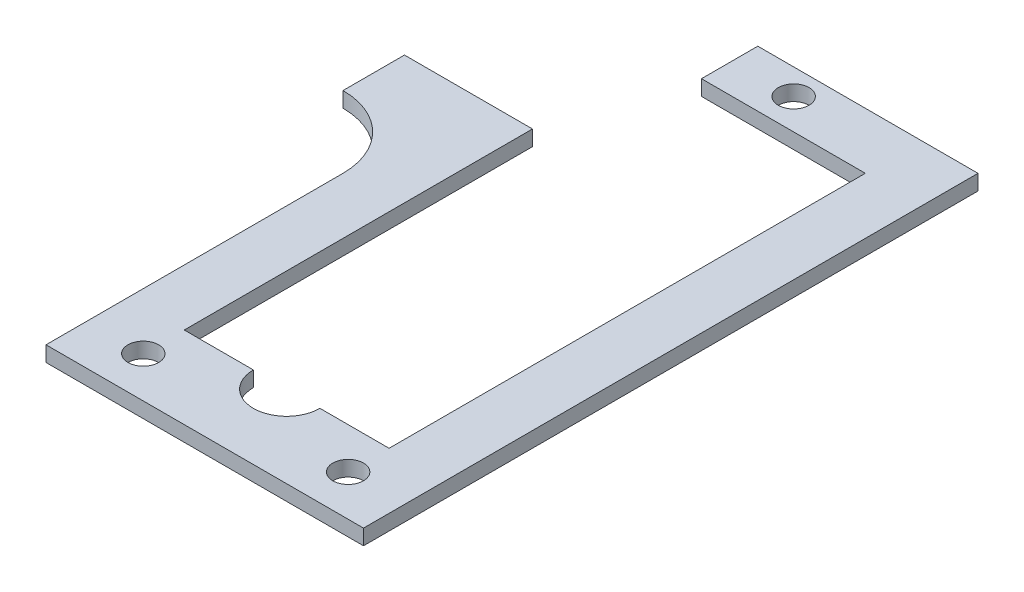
ISO-10303-21;
HEADER;
FILE_DESCRIPTION(('STEP AP214'),'2;1');
FILE_NAME('part.step','',(''),(''),'','','');
FILE_SCHEMA(('AUTOMOTIVE_DESIGN { 1 0 10303 214 1 1 1 1 }'));
ENDSEC;
DATA;
#1=APPLICATION_CONTEXT('core data for automotive mechanical design processes');
#2=APPLICATION_PROTOCOL_DEFINITION('international standard','automotive_design',2000,#1);
#3=PRODUCT_CONTEXT('',#1,'mechanical');
#4=PRODUCT('Part','Part','',(#3));
#5=PRODUCT_RELATED_PRODUCT_CATEGORY('part','',(#4));
#6=PRODUCT_DEFINITION_FORMATION('','',#4);
#7=PRODUCT_DEFINITION_CONTEXT('part definition',#1,'design');
#8=PRODUCT_DEFINITION('design','',#6,#7);
#9=PRODUCT_DEFINITION_SHAPE('','',#8);
#10=(LENGTH_UNIT() NAMED_UNIT(*) SI_UNIT(.MILLI.,.METRE.));
#11=(NAMED_UNIT(*) PLANE_ANGLE_UNIT() SI_UNIT($,.RADIAN.));
#12=(NAMED_UNIT(*) SI_UNIT($,.STERADIAN.) SOLID_ANGLE_UNIT());
#13=UNCERTAINTY_MEASURE_WITH_UNIT(LENGTH_MEASURE(1.E-05),#10,'distance_accuracy_value','');
#14=(GEOMETRIC_REPRESENTATION_CONTEXT(3) GLOBAL_UNCERTAINTY_ASSIGNED_CONTEXT((#13)) GLOBAL_UNIT_ASSIGNED_CONTEXT((#10,
#11,#12)) REPRESENTATION_CONTEXT('',''));
#15=CARTESIAN_POINT('',(0.,0.,0.));
#16=DIRECTION('',(0.,0.,1.));
#17=DIRECTION('',(1.,0.,0.));
#18=AXIS2_PLACEMENT_3D('',#15,#16,#17);
#19=CARTESIAN_POINT('',(-14.,3.,-58.));
#20=DIRECTION('',(0.,1.,0.));
#21=DIRECTION('',(0.,0.,1.));
#22=AXIS2_PLACEMENT_3D('',#19,#20,#21);
#23=PLANE('',#22);
#24=CARTESIAN_POINT('',(51.,3.,-8.));
#25=DIRECTION('',(0.,1.,0.));
#26=DIRECTION('',(0.,0.,1.));
#27=AXIS2_PLACEMENT_3D('',#24,#25,#26);
#28=CIRCLE('',#27,3.);
#29=CARTESIAN_POINT('',(51.,3.,-5.));
#30=VERTEX_POINT('',#29);
#31=EDGE_CURVE('E311',#30,#30,#28,.T.);
#32=ORIENTED_EDGE('',*,*,#31,.F.);
#33=EDGE_LOOP('',(#32));
#34=FACE_BOUND('',#33,.T.);
#35=DIRECTION('',(0.,0.,1.));
#36=VECTOR('',#35,1.);
#37=CARTESIAN_POINT('',(0.,3.,0.));
#38=LINE('',#37,#36);
#39=CARTESIAN_POINT('',(0.,3.,-58.));
#40=VERTEX_POINT('',#39);
#41=CARTESIAN_POINT('',(0.,3.,0.));
#42=VERTEX_POINT('',#41);
#43=EDGE_CURVE('E191',#40,#42,#38,.T.);
#44=ORIENTED_EDGE('',*,*,#43,.T.);
#45=DIRECTION('',(1.,0.,0.));
#46=VECTOR('',#45,1.);
#47=CARTESIAN_POINT('',(0.,3.,0.));
#48=LINE('',#47,#46);
#49=CARTESIAN_POINT('',(62.,3.,0.));
#50=VERTEX_POINT('',#49);
#51=EDGE_CURVE('E109',#42,#50,#48,.T.);
#52=ORIENTED_EDGE('',*,*,#51,.T.);
#53=DIRECTION('',(0.,0.,-1.));
#54=VECTOR('',#53,1.);
#55=CARTESIAN_POINT('',(62.,3.,0.));
#56=LINE('',#55,#54);
#57=CARTESIAN_POINT('',(62.,3.,-120.));
#58=VERTEX_POINT('',#57);
#59=EDGE_CURVE('E224',#50,#58,#56,.T.);
#60=ORIENTED_EDGE('',*,*,#59,.T.);
#61=DIRECTION('',(-1.,0.,0.));
#62=VECTOR('',#61,1.);
#63=CARTESIAN_POINT('',(19.,3.,-120.));
#64=LINE('',#63,#62);
#65=CARTESIAN_POINT('',(19.,3.,-120.));
#66=VERTEX_POINT('',#65);
#67=EDGE_CURVE('E243',#58,#66,#64,.T.);
#68=ORIENTED_EDGE('',*,*,#67,.T.);
#69=DIRECTION('',(0.,0.,1.));
#70=VECTOR('',#69,1.);
#71=CARTESIAN_POINT('',(19.,3.,-120.));
#72=LINE('',#71,#70);
#73=CARTESIAN_POINT('',(19.,3.,-109.));
#74=VERTEX_POINT('',#73);
#75=EDGE_CURVE('E240',#66,#74,#72,.T.);
#76=ORIENTED_EDGE('',*,*,#75,.T.);
#77=DIRECTION('',(1.,0.,0.));
#78=VECTOR('',#77,1.);
#79=CARTESIAN_POINT('',(19.,3.,-109.));
#80=LINE('',#79,#78);
#81=CARTESIAN_POINT('',(51.,3.,-109.));
#82=VERTEX_POINT('',#81);
#83=EDGE_CURVE('E242',#74,#82,#80,.T.);
#84=ORIENTED_EDGE('',*,*,#83,.T.);
#85=DIRECTION('',(0.,0.,1.));
#86=VECTOR('',#85,1.);
#87=CARTESIAN_POINT('',(51.,3.,-16.));
#88=LINE('',#87,#86);
#89=CARTESIAN_POINT('',(51.,3.,-16.));
#90=VERTEX_POINT('',#89);
#91=EDGE_CURVE('E245',#82,#90,#88,.T.);
#92=ORIENTED_EDGE('',*,*,#91,.T.);
#93=DIRECTION('',(-1.,0.,0.));
#94=VECTOR('',#93,1.);
#95=CARTESIAN_POINT('',(37.5,3.,-16.));
#96=LINE('',#95,#94);
#97=CARTESIAN_POINT('',(37.5,3.,-16.));
#98=VERTEX_POINT('',#97);
#99=EDGE_CURVE('E251',#90,#98,#96,.T.);
#100=ORIENTED_EDGE('',*,*,#99,.T.);
#101=CARTESIAN_POINT('',(31.,3.,-16.));
#102=DIRECTION('',(0.,-1.,0.));
#103=DIRECTION('',(0.,0.,1.));
#104=AXIS2_PLACEMENT_3D('',#101,#102,#103);
#105=CIRCLE('',#104,6.5);
#106=CARTESIAN_POINT('',(24.5,3.,-16.));
#107=VERTEX_POINT('',#106);
#108=EDGE_CURVE('E253',#98,#107,#105,.T.);
#109=ORIENTED_EDGE('',*,*,#108,.T.);
#110=DIRECTION('',(-1.,0.,0.));
#111=VECTOR('',#110,1.);
#112=CARTESIAN_POINT('',(11.,3.,-16.));
#113=LINE('',#112,#111);
#114=CARTESIAN_POINT('',(11.,3.,-16.));
#115=VERTEX_POINT('',#114);
#116=EDGE_CURVE('E255',#107,#115,#113,.T.);
#117=ORIENTED_EDGE('',*,*,#116,.T.);
#118=DIRECTION('',(0.,0.,-1.));
#119=VECTOR('',#118,1.);
#120=CARTESIAN_POINT('',(11.,3.,-16.));
#121=LINE('',#120,#119);
#122=CARTESIAN_POINT('',(11.,3.,-84.));
#123=VERTEX_POINT('',#122);
#124=EDGE_CURVE('E146',#115,#123,#121,.T.);
#125=ORIENTED_EDGE('',*,*,#124,.T.);
#126=DIRECTION('',(-1.,0.,0.));
#127=VECTOR('',#126,1.);
#128=CARTESIAN_POINT('',(11.,3.,-84.));
#129=LINE('',#128,#127);
#130=CARTESIAN_POINT('',(-14.,3.,-84.));
#131=VERTEX_POINT('',#130);
#132=EDGE_CURVE('E140',#123,#131,#129,.T.);
#133=ORIENTED_EDGE('',*,*,#132,.T.);
#134=DIRECTION('',(0.,0.,1.));
#135=VECTOR('',#134,1.);
#136=CARTESIAN_POINT('',(-14.,3.,-84.));
#137=LINE('',#136,#135);
#138=CARTESIAN_POINT('',(-14.,3.,-72.));
#139=VERTEX_POINT('',#138);
#140=EDGE_CURVE('E144',#131,#139,#137,.T.);
#141=ORIENTED_EDGE('',*,*,#140,.T.);
#142=CARTESIAN_POINT('',(-14.,3.,-58.));
#143=DIRECTION('',(0.,-1.,0.));
#144=DIRECTION('',(0.,0.,1.));
#145=AXIS2_PLACEMENT_3D('',#142,#143,#144);
#146=CIRCLE('',#145,14.);
#147=EDGE_CURVE('E48',#139,#40,#146,.T.);
#148=ORIENTED_EDGE('',*,*,#147,.T.);
#149=EDGE_LOOP('',(#44,#52,#60,#68,#76,#84,#92,#100,#109,#117,#125,#133,#141,#148));
#150=FACE_BOUND('',#149,.T.);
#151=CARTESIAN_POINT('',(11.,3.,-8.));
#152=DIRECTION('',(0.,1.,0.));
#153=DIRECTION('',(0.,0.,1.));
#154=AXIS2_PLACEMENT_3D('',#151,#152,#153);
#155=CIRCLE('',#154,3.);
#156=CARTESIAN_POINT('',(11.,3.,-5.));
#157=VERTEX_POINT('',#156);
#158=EDGE_CURVE('E168',#157,#157,#155,.T.);
#159=ORIENTED_EDGE('',*,*,#158,.F.);
#160=EDGE_LOOP('',(#159));
#161=FACE_BOUND('',#160,.T.);
#162=CARTESIAN_POINT('',(31.,3.,-115.));
#163=DIRECTION('',(0.,1.,0.));
#164=DIRECTION('',(0.,0.,1.));
#165=AXIS2_PLACEMENT_3D('',#162,#163,#164);
#166=CIRCLE('',#165,3.);
#167=CARTESIAN_POINT('',(31.,3.,-112.));
#168=VERTEX_POINT('',#167);
#169=EDGE_CURVE('E302',#168,#168,#166,.T.);
#170=ORIENTED_EDGE('',*,*,#169,.F.);
#171=EDGE_LOOP('',(#170));
#172=FACE_BOUND('',#171,.T.);
#173=ADVANCED_FACE('F31',(#34,#150,#161,#172),#23,.T.);
#174=CARTESIAN_POINT('',(-14.,0.,-58.));
#175=DIRECTION('',(0.,1.,0.));
#176=DIRECTION('',(0.,0.,1.));
#177=AXIS2_PLACEMENT_3D('',#174,#175,#176);
#178=PLANE('',#177);
#179=CARTESIAN_POINT('',(51.,0.,-8.));
#180=DIRECTION('',(0.,1.,0.));
#181=DIRECTION('',(0.,0.,1.));
#182=AXIS2_PLACEMENT_3D('',#179,#180,#181);
#183=CIRCLE('',#182,3.);
#184=CARTESIAN_POINT('',(51.,0.,-5.));
#185=VERTEX_POINT('',#184);
#186=EDGE_CURVE('E308',#185,#185,#183,.T.);
#187=ORIENTED_EDGE('',*,*,#186,.T.);
#188=EDGE_LOOP('',(#187));
#189=FACE_BOUND('',#188,.T.);
#190=DIRECTION('',(0.,0.,1.));
#191=VECTOR('',#190,1.);
#192=CARTESIAN_POINT('',(0.,0.,0.));
#193=LINE('',#192,#191);
#194=CARTESIAN_POINT('',(0.,0.,-58.));
#195=VERTEX_POINT('',#194);
#196=CARTESIAN_POINT('',(0.,0.,0.));
#197=VERTEX_POINT('',#196);
#198=EDGE_CURVE('E164',#195,#197,#193,.T.);
#199=ORIENTED_EDGE('',*,*,#198,.F.);
#200=CARTESIAN_POINT('',(-14.,0.,-58.));
#201=DIRECTION('',(0.,-1.,0.));
#202=DIRECTION('',(0.,0.,1.));
#203=AXIS2_PLACEMENT_3D('',#200,#201,#202);
#204=CIRCLE('',#203,14.);
#205=CARTESIAN_POINT('',(-14.,0.,-72.));
#206=VERTEX_POINT('',#205);
#207=EDGE_CURVE('E101',#206,#195,#204,.T.);
#208=ORIENTED_EDGE('',*,*,#207,.F.);
#209=DIRECTION('',(0.,0.,1.));
#210=VECTOR('',#209,1.);
#211=CARTESIAN_POINT('',(-14.,0.,-84.));
#212=LINE('',#211,#210);
#213=CARTESIAN_POINT('',(-14.,0.,-84.));
#214=VERTEX_POINT('',#213);
#215=EDGE_CURVE('E95',#214,#206,#212,.T.);
#216=ORIENTED_EDGE('',*,*,#215,.F.);
#217=DIRECTION('',(-1.,0.,0.));
#218=VECTOR('',#217,1.);
#219=CARTESIAN_POINT('',(11.,0.,-84.));
#220=LINE('',#219,#218);
#221=CARTESIAN_POINT('',(11.,0.,-84.));
#222=VERTEX_POINT('',#221);
#223=EDGE_CURVE('E154',#222,#214,#220,.T.);
#224=ORIENTED_EDGE('',*,*,#223,.F.);
#225=DIRECTION('',(0.,0.,-1.));
#226=VECTOR('',#225,1.);
#227=CARTESIAN_POINT('',(11.,0.,-16.));
#228=LINE('',#227,#226);
#229=CARTESIAN_POINT('',(11.,0.,-16.));
#230=VERTEX_POINT('',#229);
#231=EDGE_CURVE('E186',#230,#222,#228,.T.);
#232=ORIENTED_EDGE('',*,*,#231,.F.);
#233=DIRECTION('',(-1.,0.,0.));
#234=VECTOR('',#233,1.);
#235=CARTESIAN_POINT('',(11.,0.,-16.));
#236=LINE('',#235,#234);
#237=CARTESIAN_POINT('',(24.5,0.,-16.));
#238=VERTEX_POINT('',#237);
#239=EDGE_CURVE('E184',#238,#230,#236,.T.);
#240=ORIENTED_EDGE('',*,*,#239,.F.);
#241=CARTESIAN_POINT('',(31.,0.,-16.));
#242=DIRECTION('',(0.,-1.,0.));
#243=DIRECTION('',(0.,0.,1.));
#244=AXIS2_PLACEMENT_3D('',#241,#242,#243);
#245=CIRCLE('',#244,6.5);
#246=CARTESIAN_POINT('',(37.5,0.,-16.));
#247=VERTEX_POINT('',#246);
#248=EDGE_CURVE('E182',#247,#238,#245,.T.);
#249=ORIENTED_EDGE('',*,*,#248,.F.);
#250=DIRECTION('',(-1.,0.,0.));
#251=VECTOR('',#250,1.);
#252=CARTESIAN_POINT('',(37.5,0.,-16.));
#253=LINE('',#252,#251);
#254=CARTESIAN_POINT('',(51.,0.,-16.));
#255=VERTEX_POINT('',#254);
#256=EDGE_CURVE('E180',#255,#247,#253,.T.);
#257=ORIENTED_EDGE('',*,*,#256,.F.);
#258=DIRECTION('',(0.,0.,1.));
#259=VECTOR('',#258,1.);
#260=CARTESIAN_POINT('',(51.,0.,-16.));
#261=LINE('',#260,#259);
#262=CARTESIAN_POINT('',(51.,0.,-109.));
#263=VERTEX_POINT('',#262);
#264=EDGE_CURVE('E178',#263,#255,#261,.T.);
#265=ORIENTED_EDGE('',*,*,#264,.F.);
#266=DIRECTION('',(1.,0.,0.));
#267=VECTOR('',#266,1.);
#268=CARTESIAN_POINT('',(19.,0.,-109.));
#269=LINE('',#268,#267);
#270=CARTESIAN_POINT('',(19.,0.,-109.));
#271=VERTEX_POINT('',#270);
#272=EDGE_CURVE('E176',#271,#263,#269,.T.);
#273=ORIENTED_EDGE('',*,*,#272,.F.);
#274=DIRECTION('',(0.,0.,1.));
#275=VECTOR('',#274,1.);
#276=CARTESIAN_POINT('',(19.,0.,-120.));
#277=LINE('',#276,#275);
#278=CARTESIAN_POINT('',(19.,0.,-120.));
#279=VERTEX_POINT('',#278);
#280=EDGE_CURVE('E174',#279,#271,#277,.T.);
#281=ORIENTED_EDGE('',*,*,#280,.F.);
#282=DIRECTION('',(-1.,0.,0.));
#283=VECTOR('',#282,1.);
#284=CARTESIAN_POINT('',(19.,0.,-120.));
#285=LINE('',#284,#283);
#286=CARTESIAN_POINT('',(62.,0.,-120.));
#287=VERTEX_POINT('',#286);
#288=EDGE_CURVE('E172',#287,#279,#285,.T.);
#289=ORIENTED_EDGE('',*,*,#288,.F.);
#290=DIRECTION('',(0.,0.,-1.));
#291=VECTOR('',#290,1.);
#292=CARTESIAN_POINT('',(62.,0.,0.));
#293=LINE('',#292,#291);
#294=CARTESIAN_POINT('',(62.,0.,0.));
#295=VERTEX_POINT('',#294);
#296=EDGE_CURVE('E170',#295,#287,#293,.T.);
#297=ORIENTED_EDGE('',*,*,#296,.F.);
#298=DIRECTION('',(1.,0.,0.));
#299=VECTOR('',#298,1.);
#300=CARTESIAN_POINT('',(0.,0.,0.));
#301=LINE('',#300,#299);
#302=EDGE_CURVE('E167',#197,#295,#301,.T.);
#303=ORIENTED_EDGE('',*,*,#302,.F.);
#304=EDGE_LOOP('',(#199,#208,#216,#224,#232,#240,#249,#257,#265,#273,#281,#289,#297,#303));
#305=FACE_BOUND('',#304,.T.);
#306=CARTESIAN_POINT('',(11.,0.,-8.));
#307=DIRECTION('',(0.,1.,0.));
#308=DIRECTION('',(0.,0.,1.));
#309=AXIS2_PLACEMENT_3D('',#306,#307,#308);
#310=CIRCLE('',#309,3.);
#311=CARTESIAN_POINT('',(11.,0.,-5.));
#312=VERTEX_POINT('',#311);
#313=EDGE_CURVE('E314',#312,#312,#310,.T.);
#314=ORIENTED_EDGE('',*,*,#313,.T.);
#315=EDGE_LOOP('',(#314));
#316=FACE_BOUND('',#315,.T.);
#317=CARTESIAN_POINT('',(31.,0.,-115.));
#318=DIRECTION('',(0.,1.,0.));
#319=DIRECTION('',(0.,0.,1.));
#320=AXIS2_PLACEMENT_3D('',#317,#318,#319);
#321=CIRCLE('',#320,3.);
#322=CARTESIAN_POINT('',(31.,0.,-112.));
#323=VERTEX_POINT('',#322);
#324=EDGE_CURVE('E305',#323,#323,#321,.T.);
#325=ORIENTED_EDGE('',*,*,#324,.T.);
#326=EDGE_LOOP('',(#325));
#327=FACE_BOUND('',#326,.T.);
#328=ADVANCED_FACE('F228',(#189,#305,#316,#327),#178,.F.);
#329=CARTESIAN_POINT('',(0.,3.,0.));
#330=DIRECTION('',(1.,0.,0.));
#331=DIRECTION('',(0.,0.,-1.));
#332=AXIS2_PLACEMENT_3D('',#329,#330,#331);
#333=PLANE('',#332);
#334=ORIENTED_EDGE('',*,*,#198,.T.);
#335=DIRECTION('',(0.,-1.,0.));
#336=VECTOR('',#335,1.);
#337=CARTESIAN_POINT('',(0.,3.,0.));
#338=LINE('',#337,#336);
#339=EDGE_CURVE('E11',#42,#197,#338,.T.);
#340=ORIENTED_EDGE('',*,*,#339,.F.);
#341=ORIENTED_EDGE('',*,*,#43,.F.);
#342=DIRECTION('',(0.,-1.,0.));
#343=VECTOR('',#342,1.);
#344=CARTESIAN_POINT('',(0.,3.,-58.));
#345=LINE('',#344,#343);
#346=EDGE_CURVE('E160',#40,#195,#345,.T.);
#347=ORIENTED_EDGE('',*,*,#346,.T.);
#348=EDGE_LOOP('',(#334,#340,#341,#347));
#349=FACE_BOUND('',#348,.T.);
#350=ADVANCED_FACE('F33',(#349),#333,.F.);
#351=CARTESIAN_POINT('',(0.,3.,0.));
#352=DIRECTION('',(0.,0.,-1.));
#353=DIRECTION('',(-1.,0.,0.));
#354=AXIS2_PLACEMENT_3D('',#351,#352,#353);
#355=PLANE('',#354);
#356=ORIENTED_EDGE('',*,*,#302,.T.);
#357=DIRECTION('',(0.,-1.,0.));
#358=VECTOR('',#357,1.);
#359=CARTESIAN_POINT('',(62.,3.,0.));
#360=LINE('',#359,#358);
#361=EDGE_CURVE('E40',#50,#295,#360,.T.);
#362=ORIENTED_EDGE('',*,*,#361,.F.);
#363=ORIENTED_EDGE('',*,*,#51,.F.);
#364=ORIENTED_EDGE('',*,*,#339,.T.);
#365=EDGE_LOOP('',(#356,#362,#363,#364));
#366=FACE_BOUND('',#365,.T.);
#367=ADVANCED_FACE('F435',(#366),#355,.F.);
#368=CARTESIAN_POINT('',(62.,3.,0.));
#369=DIRECTION('',(-1.,0.,0.));
#370=DIRECTION('',(0.,0.,1.));
#371=AXIS2_PLACEMENT_3D('',#368,#369,#370);
#372=PLANE('',#371);
#373=ORIENTED_EDGE('',*,*,#296,.T.);
#374=DIRECTION('',(0.,-1.,0.));
#375=VECTOR('',#374,1.);
#376=CARTESIAN_POINT('',(62.,3.,-120.));
#377=LINE('',#376,#375);
#378=EDGE_CURVE('E216',#58,#287,#377,.T.);
#379=ORIENTED_EDGE('',*,*,#378,.F.);
#380=ORIENTED_EDGE('',*,*,#59,.F.);
#381=ORIENTED_EDGE('',*,*,#361,.T.);
#382=EDGE_LOOP('',(#373,#379,#380,#381));
#383=FACE_BOUND('',#382,.T.);
#384=ADVANCED_FACE('F222',(#383),#372,.F.);
#385=CARTESIAN_POINT('',(19.,3.,-120.));
#386=DIRECTION('',(0.,0.,1.));
#387=DIRECTION('',(1.,0.,0.));
#388=AXIS2_PLACEMENT_3D('',#385,#386,#387);
#389=PLANE('',#388);
#390=ORIENTED_EDGE('',*,*,#288,.T.);
#391=DIRECTION('',(0.,-1.,0.));
#392=VECTOR('',#391,1.);
#393=CARTESIAN_POINT('',(19.,3.,-120.));
#394=LINE('',#393,#392);
#395=EDGE_CURVE('E213',#66,#279,#394,.T.);
#396=ORIENTED_EDGE('',*,*,#395,.F.);
#397=ORIENTED_EDGE('',*,*,#67,.F.);
#398=ORIENTED_EDGE('',*,*,#378,.T.);
#399=EDGE_LOOP('',(#390,#396,#397,#398));
#400=FACE_BOUND('',#399,.T.);
#401=ADVANCED_FACE('F234',(#400),#389,.F.);
#402=CARTESIAN_POINT('',(19.,3.,-120.));
#403=DIRECTION('',(1.,0.,0.));
#404=DIRECTION('',(0.,0.,-1.));
#405=AXIS2_PLACEMENT_3D('',#402,#403,#404);
#406=PLANE('',#405);
#407=ORIENTED_EDGE('',*,*,#280,.T.);
#408=DIRECTION('',(0.,-1.,0.));
#409=VECTOR('',#408,1.);
#410=CARTESIAN_POINT('',(19.,3.,-109.));
#411=LINE('',#410,#409);
#412=EDGE_CURVE('E210',#74,#271,#411,.T.);
#413=ORIENTED_EDGE('',*,*,#412,.F.);
#414=ORIENTED_EDGE('',*,*,#75,.F.);
#415=ORIENTED_EDGE('',*,*,#395,.T.);
#416=EDGE_LOOP('',(#407,#413,#414,#415));
#417=FACE_BOUND('',#416,.T.);
#418=ADVANCED_FACE('F238',(#417),#406,.F.);
#419=CARTESIAN_POINT('',(19.,3.,-109.));
#420=DIRECTION('',(0.,0.,-1.));
#421=DIRECTION('',(-1.,0.,0.));
#422=AXIS2_PLACEMENT_3D('',#419,#420,#421);
#423=PLANE('',#422);
#424=ORIENTED_EDGE('',*,*,#272,.T.);
#425=DIRECTION('',(0.,-1.,0.));
#426=VECTOR('',#425,1.);
#427=CARTESIAN_POINT('',(51.,3.,-109.));
#428=LINE('',#427,#426);
#429=EDGE_CURVE('E207',#82,#263,#428,.T.);
#430=ORIENTED_EDGE('',*,*,#429,.F.);
#431=ORIENTED_EDGE('',*,*,#83,.F.);
#432=ORIENTED_EDGE('',*,*,#412,.T.);
#433=EDGE_LOOP('',(#424,#430,#431,#432));
#434=FACE_BOUND('',#433,.T.);
#435=ADVANCED_FACE('F400',(#434),#423,.F.);
#436=CARTESIAN_POINT('',(51.,3.,-16.));
#437=DIRECTION('',(1.,0.,0.));
#438=DIRECTION('',(0.,0.,-1.));
#439=AXIS2_PLACEMENT_3D('',#436,#437,#438);
#440=PLANE('',#439);
#441=ORIENTED_EDGE('',*,*,#264,.T.);
#442=DIRECTION('',(0.,-1.,0.));
#443=VECTOR('',#442,1.);
#444=CARTESIAN_POINT('',(51.,3.,-16.));
#445=LINE('',#444,#443);
#446=EDGE_CURVE('E204',#90,#255,#445,.T.);
#447=ORIENTED_EDGE('',*,*,#446,.F.);
#448=ORIENTED_EDGE('',*,*,#91,.F.);
#449=ORIENTED_EDGE('',*,*,#429,.T.);
#450=EDGE_LOOP('',(#441,#447,#448,#449));
#451=FACE_BOUND('',#450,.T.);
#452=ADVANCED_FACE('F390',(#451),#440,.F.);
#453=CARTESIAN_POINT('',(37.5,3.,-16.));
#454=DIRECTION('',(0.,0.,1.));
#455=DIRECTION('',(1.,0.,0.));
#456=AXIS2_PLACEMENT_3D('',#453,#454,#455);
#457=PLANE('',#456);
#458=ORIENTED_EDGE('',*,*,#256,.T.);
#459=DIRECTION('',(0.,-1.,0.));
#460=VECTOR('',#459,1.);
#461=CARTESIAN_POINT('',(37.5,3.,-16.));
#462=LINE('',#461,#460);
#463=EDGE_CURVE('E201',#98,#247,#462,.T.);
#464=ORIENTED_EDGE('',*,*,#463,.F.);
#465=ORIENTED_EDGE('',*,*,#99,.F.);
#466=ORIENTED_EDGE('',*,*,#446,.T.);
#467=EDGE_LOOP('',(#458,#464,#465,#466));
#468=FACE_BOUND('',#467,.T.);
#469=ADVANCED_FACE('F380',(#468),#457,.F.);
#470=CARTESIAN_POINT('',(31.,3.,-16.));
#471=DIRECTION('',(0.,-1.,0.));
#472=DIRECTION('',(0.,0.,-1.));
#473=AXIS2_PLACEMENT_3D('',#470,#471,#472);
#474=CYLINDRICAL_SURFACE('',#473,6.5);
#475=ORIENTED_EDGE('',*,*,#248,.T.);
#476=DIRECTION('',(0.,-1.,0.));
#477=VECTOR('',#476,1.);
#478=CARTESIAN_POINT('',(24.5,3.,-16.));
#479=LINE('',#478,#477);
#480=EDGE_CURVE('E198',#107,#238,#479,.T.);
#481=ORIENTED_EDGE('',*,*,#480,.F.);
#482=ORIENTED_EDGE('',*,*,#108,.F.);
#483=ORIENTED_EDGE('',*,*,#463,.T.);
#484=EDGE_LOOP('',(#475,#481,#482,#483));
#485=FACE_BOUND('',#484,.T.);
#486=ADVANCED_FACE('F371',(#485),#474,.F.);
#487=CARTESIAN_POINT('',(11.,3.,-16.));
#488=DIRECTION('',(0.,0.,1.));
#489=DIRECTION('',(1.,0.,0.));
#490=AXIS2_PLACEMENT_3D('',#487,#488,#489);
#491=PLANE('',#490);
#492=ORIENTED_EDGE('',*,*,#239,.T.);
#493=DIRECTION('',(0.,-1.,0.));
#494=VECTOR('',#493,1.);
#495=CARTESIAN_POINT('',(11.,3.,-16.));
#496=LINE('',#495,#494);
#497=EDGE_CURVE('E195',#115,#230,#496,.T.);
#498=ORIENTED_EDGE('',*,*,#497,.F.);
#499=ORIENTED_EDGE('',*,*,#116,.F.);
#500=ORIENTED_EDGE('',*,*,#480,.T.);
#501=EDGE_LOOP('',(#492,#498,#499,#500));
#502=FACE_BOUND('',#501,.T.);
#503=ADVANCED_FACE('F261',(#502),#491,.F.);
#504=CARTESIAN_POINT('',(11.,3.,-16.));
#505=DIRECTION('',(-1.,0.,0.));
#506=DIRECTION('',(0.,0.,1.));
#507=AXIS2_PLACEMENT_3D('',#504,#505,#506);
#508=PLANE('',#507);
#509=ORIENTED_EDGE('',*,*,#231,.T.);
#510=DIRECTION('',(0.,-1.,0.));
#511=VECTOR('',#510,1.);
#512=CARTESIAN_POINT('',(11.,3.,-84.));
#513=LINE('',#512,#511);
#514=EDGE_CURVE('E155',#123,#222,#513,.T.);
#515=ORIENTED_EDGE('',*,*,#514,.F.);
#516=ORIENTED_EDGE('',*,*,#124,.F.);
#517=ORIENTED_EDGE('',*,*,#497,.T.);
#518=EDGE_LOOP('',(#509,#515,#516,#517));
#519=FACE_BOUND('',#518,.T.);
#520=ADVANCED_FACE('F265',(#519),#508,.F.);
#521=CARTESIAN_POINT('',(11.,3.,-84.));
#522=DIRECTION('',(0.,0.,1.));
#523=DIRECTION('',(1.,0.,0.));
#524=AXIS2_PLACEMENT_3D('',#521,#522,#523);
#525=PLANE('',#524);
#526=ORIENTED_EDGE('',*,*,#223,.T.);
#527=DIRECTION('',(0.,-1.,0.));
#528=VECTOR('',#527,1.);
#529=CARTESIAN_POINT('',(-14.,3.,-84.));
#530=LINE('',#529,#528);
#531=EDGE_CURVE('E151',#131,#214,#530,.T.);
#532=ORIENTED_EDGE('',*,*,#531,.F.);
#533=ORIENTED_EDGE('',*,*,#132,.F.);
#534=ORIENTED_EDGE('',*,*,#514,.T.);
#535=EDGE_LOOP('',(#526,#532,#533,#534));
#536=FACE_BOUND('',#535,.T.);
#537=ADVANCED_FACE('F152',(#536),#525,.F.);
#538=CARTESIAN_POINT('',(-14.,3.,-84.));
#539=DIRECTION('',(1.,0.,0.));
#540=DIRECTION('',(0.,0.,-1.));
#541=AXIS2_PLACEMENT_3D('',#538,#539,#540);
#542=PLANE('',#541);
#543=ORIENTED_EDGE('',*,*,#215,.T.);
#544=DIRECTION('',(0.,-1.,0.));
#545=VECTOR('',#544,1.);
#546=CARTESIAN_POINT('',(-14.,3.,-72.));
#547=LINE('',#546,#545);
#548=EDGE_CURVE('E156',#139,#206,#547,.T.);
#549=ORIENTED_EDGE('',*,*,#548,.F.);
#550=ORIENTED_EDGE('',*,*,#140,.F.);
#551=ORIENTED_EDGE('',*,*,#531,.T.);
#552=EDGE_LOOP('',(#543,#549,#550,#551));
#553=FACE_BOUND('',#552,.T.);
#554=ADVANCED_FACE('F158',(#553),#542,.F.);
#555=CARTESIAN_POINT('',(-14.,3.,-58.));
#556=DIRECTION('',(0.,-1.,0.));
#557=DIRECTION('',(0.,0.,-1.));
#558=AXIS2_PLACEMENT_3D('',#555,#556,#557);
#559=CYLINDRICAL_SURFACE('',#558,14.);
#560=ORIENTED_EDGE('',*,*,#207,.T.);
#561=ORIENTED_EDGE('',*,*,#346,.F.);
#562=ORIENTED_EDGE('',*,*,#147,.F.);
#563=ORIENTED_EDGE('',*,*,#548,.T.);
#564=EDGE_LOOP('',(#560,#561,#562,#563));
#565=FACE_BOUND('',#564,.T.);
#566=ADVANCED_FACE('F269',(#565),#559,.F.);
#567=CARTESIAN_POINT('',(11.,3.,-8.));
#568=DIRECTION('',(0.,-1.,0.));
#569=DIRECTION('',(0.,0.,-1.));
#570=AXIS2_PLACEMENT_3D('',#567,#568,#569);
#571=CYLINDRICAL_SURFACE('',#570,3.);
#572=ORIENTED_EDGE('',*,*,#158,.T.);
#573=EDGE_LOOP('',(#572));
#574=FACE_BOUND('',#573,.T.);
#575=ORIENTED_EDGE('',*,*,#313,.F.);
#576=EDGE_LOOP('',(#575));
#577=FACE_BOUND('',#576,.T.);
#578=ADVANCED_FACE('F271',(#574,#577),#571,.F.);
#579=CARTESIAN_POINT('',(51.,3.,-8.));
#580=DIRECTION('',(0.,-1.,0.));
#581=DIRECTION('',(0.,0.,-1.));
#582=AXIS2_PLACEMENT_3D('',#579,#580,#581);
#583=CYLINDRICAL_SURFACE('',#582,3.);
#584=ORIENTED_EDGE('',*,*,#31,.T.);
#585=EDGE_LOOP('',(#584));
#586=FACE_BOUND('',#585,.T.);
#587=ORIENTED_EDGE('',*,*,#186,.F.);
#588=EDGE_LOOP('',(#587));
#589=FACE_BOUND('',#588,.T.);
#590=ADVANCED_FACE('F277',(#586,#589),#583,.F.);
#591=CARTESIAN_POINT('',(31.,3.,-115.));
#592=DIRECTION('',(0.,-1.,0.));
#593=DIRECTION('',(0.,0.,-1.));
#594=AXIS2_PLACEMENT_3D('',#591,#592,#593);
#595=CYLINDRICAL_SURFACE('',#594,3.);
#596=ORIENTED_EDGE('',*,*,#169,.T.);
#597=EDGE_LOOP('',(#596));
#598=FACE_BOUND('',#597,.T.);
#599=ORIENTED_EDGE('',*,*,#324,.F.);
#600=EDGE_LOOP('',(#599));
#601=FACE_BOUND('',#600,.T.);
#602=ADVANCED_FACE('F293',(#598,#601),#595,.F.);
#603=CLOSED_SHELL('',(#173,#328,#350,#367,#384,#401,#418,#435,#452,#469,#486,#503,#520,#537,
#554,#566,#578,#590,#602));
#604=MANIFOLD_SOLID_BREP('B2',#603);
#605=ADVANCED_BREP_SHAPE_REPRESENTATION('',(#18,#604),#14);
#606=SHAPE_DEFINITION_REPRESENTATION(#9,#605);
ENDSEC;
END-ISO-10303-21;
